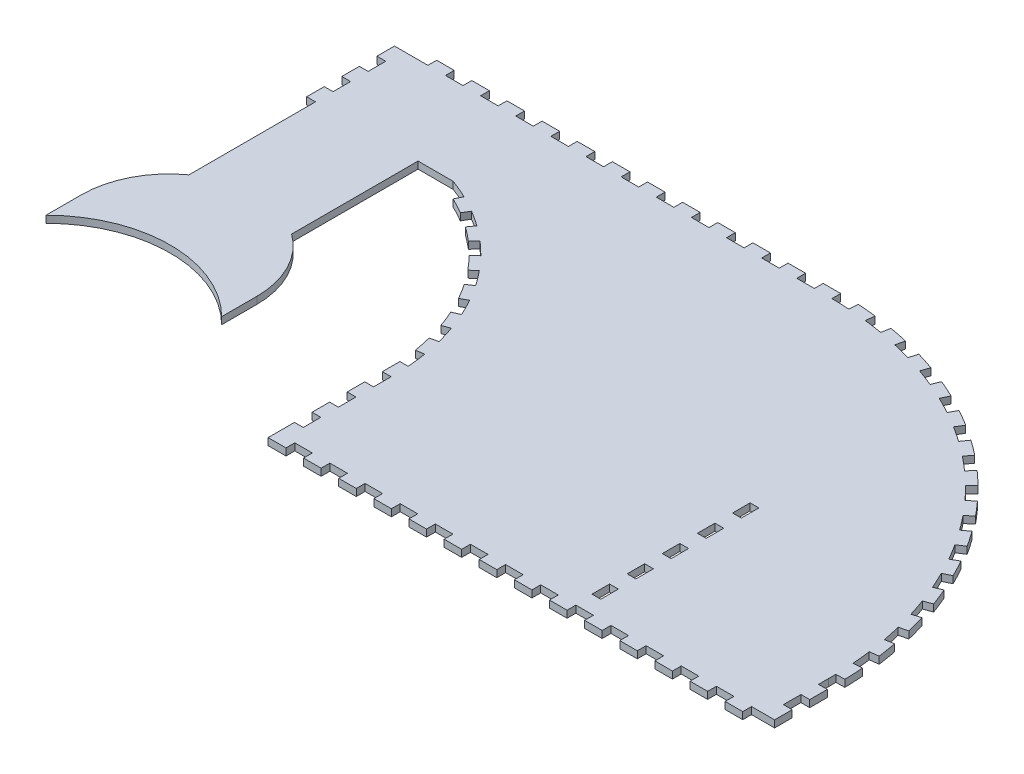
from build123d import *

# Parameters (mm, degrees)
MAIN_SHAPE_DEPTH                = 2.54
SKETCH17_W                      = 3.175
SKETCH17_H                      = 6.35
DISPLAY_AND_CONTROLS_DEPTH      = 3.175
SKETCH19_W                      = 3.175
SKETCH19_H                      = 6.35
TEETH_NEAR_BACK_DEPTH           = 2.54
LPATTERN1_COUNT                 = 3
LPATTERN1_PITCH                 = 12.7
SKETCH20_W                      = 3.175
SKETCH20_H                      = 6.35
TEETH_SHORT_EXTERIOR_DEPTH      = 2.54
LPATTERN2_COUNT                 = 2
LPATTERN2_PITCH                 = 12.7
TEETH_EXTERIOR_CURVE_DEPTH      = 2.54
TEETH_ACROSS_BACK_DEPTH         = 2.54
LPATTERN3_COUNT                 = 12
LPATTERN3_PITCH                 = 12.7
SKETCH23_W                      = 3.175
SKETCH23_H                      = 6.35
TEETH_SHORT_INTERIOR_DEPTH      = 2.54
LPATTERN4_COUNT                 = 4
LPATTERN4_PITCH                 = 12.7
TEETH_INTERIOR_CURVE_DEPTH      = 2.54
SKETCH25_W                      = 6.4516
SKETCH25_H                      = 3.175
TEETH_CORNER_SNAGGLETOOTH_DEPTH = 2.54
SKETCH26_W                      = 6.35
SKETCH26_H                      = 3.175
TEETH_ACROSS_FRONT_DEPTH        = 2.54
LPATTERN5_COUNT                 = 13
LPATTERN5_PITCH                 = 12.7
BOSS_EXTRUDE1_DEPTH             = 2.54


with BuildPart() as part:
    # Sketch1 → main shape (new body)
    with BuildSketch(Plane(origin=(0, 0, 0), x_dir=(1, 0, 0), z_dir=(0, 1, 0))):
        with BuildLine():
            Line((254.731571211, -49.489780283), (254.731571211, -26.862706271))
            ThreePointArc((254.731571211, -26.862706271), (219.698386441, 57.714883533), (135.120796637, 92.748068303))
            Line((135.120796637, 92.748068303), (43.942, 92.748068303))
            Line((43.942, 92.748068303), (-18.542, 92.748068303))
            Line((-18.542, 92.748068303), (-18.542, 60.998068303))
            Line((-18.542, 60.998068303), (-18.542, 22.898068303))
            Line((-18.542, 22.898068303), (18.542, 22.898068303))
            Line((18.542, 22.898068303), (18.542, 60.998068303))
            Line((18.542, 60.998068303), (31.242, 60.998068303))
            ThreePointArc((31.242, 60.998068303), (67.466558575, 33.08647736), (81.188839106, -10.536619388))
            Line((81.188839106, -10.536619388), (81.188839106, -49.489780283))
            Line((81.188839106, -49.489780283), (89.223526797, -49.489780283))
            Line((89.223526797, -49.489780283), (241.56969011, -49.489780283))
            Line((241.56969011, -49.489780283), (254.731571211, -49.489780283))
        make_face()
    extrude(amount=MAIN_SHAPE_DEPTH)

    # Sketch17 → display and controls (cut)
    with BuildSketch(Plane(origin=(0, 2.54, 0), x_dir=(1, 0, 0), z_dir=(0, 1, 0))):
        with Locations((187.140408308, -39.964780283)):
            Rectangle(SKETCH17_W, SKETCH17_H)
        with Locations((187.140408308, -27.264780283)):
            Rectangle(SKETCH17_W, SKETCH17_H)
        with Locations((187.140408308, -14.564780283)):
            Rectangle(SKETCH17_W, SKETCH17_H)
        with Locations((187.140408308, -1.864780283)):
            Rectangle(SKETCH17_W, SKETCH17_H)
        with Locations((187.140408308, 10.835219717)):
            Rectangle(SKETCH17_W, SKETCH17_H)
    extrude(amount=-DISPLAY_AND_CONTROLS_DEPTH, mode=Mode.SUBTRACT)

    # Sketch19 → teeth near back (add)
    with BuildSketch(Plane(origin=(0, 2.54, 0), x_dir=(1, 0, 0), z_dir=(0, 1, 0))):
        with Locations((-20.1295, 89.573068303)):
            Rectangle(SKETCH19_W, SKETCH19_H)
    teeth_near_back = extrude(amount=-TEETH_NEAR_BACK_DEPTH)

    # LPattern1: teeth near back ×3
    with Locations(*[(0, 0, i * LPATTERN1_PITCH) for i in range(1, LPATTERN1_COUNT)]):
        add(teeth_near_back)

    # Sketch20 → teeth short exterior (add)
    with BuildSketch(Plane(origin=(0, 2.54, 0), x_dir=(1, 0, 0), z_dir=(0, 1, 0))):
        with Locations((256.319071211, -46.314780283)):
            Rectangle(SKETCH20_W, SKETCH20_H)
    teeth_short_exterior = extrude(amount=-TEETH_SHORT_EXTERIOR_DEPTH)

    # LPattern2: teeth short exterior ×2
    with Locations(*[(0, 0, -i * LPATTERN2_PITCH) for i in range(1, LPATTERN2_COUNT)]):
        add(teeth_short_exterior)

    # Sketch21 → teeth exterior curve (add)
    with BuildSketch(Plane(origin=(0, 2.54, 0), x_dir=(1, 0, 0), z_dir=(0, 1, 0))):
        with BuildLine():
            Line((252.54392406, -24.210887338), (257.906571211, -24.089780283))
            ThreePointArc((257.906571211, -24.089780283), (257.783967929, -20.716002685), (257.568681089, -17.3468695))
            Line((257.568681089, -17.3468695), (252.22079123, -17.762472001))
            ThreePointArc((252.22079123, -17.762472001), (252.426675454, -20.984458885), (252.54392406, -24.210887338))
        make_face()
        with BuildLine():
            Line((251.543805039, -11.341555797), (256.860777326, -10.632713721))
            ThreePointArc((256.860777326, -10.632713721), (256.36869529, -7.292764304), (255.784999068, -3.967601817))
            Line((255.784999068, -3.967601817), (250.515011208, -4.967541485))
            ThreePointArc((250.515011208, -4.967541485), (251.0732146, -8.147478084), (251.543805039, -11.341555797))
        make_face()
        with BuildLine():
            ThreePointArc((247.415489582, 7.562937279), (248.31927011, 4.463458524), (249.137518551, 1.340309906))
            Line((249.137518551, 1.340309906), (254.344597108, 2.628325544))
            ThreePointArc((254.344597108, 2.628325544), (253.488979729, 5.894106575), (252.54392406, 9.135136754))
            Line((252.54392406, 9.135136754), (247.415489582, 7.562937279))
        make_face()
        with BuildLine():
            ThreePointArc((242.95966265, 19.677620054), (244.198104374, 16.696034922), (245.354127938, 13.681537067))
            Line((245.354127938, 13.681537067), (250.388421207, 15.533169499))
            ThreePointArc((250.388421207, 15.533169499), (249.179602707, 18.685337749), (247.884602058, 21.803090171))
            Line((247.884602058, 21.803090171), (242.95966265, 19.677620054))
        make_face()
        with BuildLine():
            ThreePointArc((237.201348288, 31.230184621), (238.759493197, 28.402504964), (240.239329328, 25.533067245))
            Line((240.239329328, 25.533067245), (245.040032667, 27.92595229))
            ThreePointArc((245.040032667, 27.92595229), (243.492613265, 30.926435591), (241.863308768, 33.883253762))
            Line((241.863308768, 33.883253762), (237.201348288, 31.230184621))
        make_face()
        with BuildLine():
            ThreePointArc((230.210095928, 42.081098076), (232.069124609, 39.441476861), (233.854899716, 36.751756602))
            Line((233.854899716, 36.751756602), (238.364029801, 39.656992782))
            ThreePointArc((238.364029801, 39.656992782), (236.496699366, 42.469551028), (234.552769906, 45.229722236))
            Line((234.552769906, 45.229722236), (230.210095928, 42.081098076))
        make_face()
        with BuildLine():
            ThreePointArc((222.07034654, 52.09930212), (224.20780548, 49.679620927), (226.27795081, 47.20210481))
            Line((226.27795081, 47.20210481), (230.441045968, 50.584602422))
            ThreePointArc((230.441045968, 50.584602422), (228.276358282, 53.175265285), (226.041282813, 55.705451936))
            Line((226.041282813, 55.705451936), (222.07034654, 52.09930212))
        make_face()
        with BuildLine():
            ThreePointArc((212.880412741, 61.163795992), (215.270485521, 58.993279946), (217.599997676, 56.757891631))
            Line((217.599997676, 56.757891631), (221.36677567, 60.576796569))
            ThreePointArc((221.36677567, 60.576796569), (218.930876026, 62.914273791), (216.431649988, 65.183916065))
            Line((216.431649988, 65.183916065), (212.880412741, 61.163795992))
        make_face()
        with BuildLine():
            ThreePointArc((202.751291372, 69.165097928), (205.365110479, 67.269962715), (207.925853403, 65.303701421))
            Line((207.925853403, 65.303701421), (211.250818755, 69.512888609))
            ThreePointArc((211.250818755, 69.512888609), (208.573128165, 71.568947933), (205.839937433, 73.55063289))
            Line((205.839937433, 73.55063289), (202.751291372, 69.165097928))
        make_face()
        with BuildLine():
            ThreePointArc((191.805322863, 76.006567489), (194.611318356, 74.409702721), (197.372363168, 72.736317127))
            Line((197.372363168, 72.736317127), (200.21535665, 77.284947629))
            ThreePointArc((200.21535665, 77.284947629), (197.328216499, 79.034755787), (194.394072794, 80.704548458))
            Line((194.394072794, 80.704548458), (191.805322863, 76.006567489))
        make_face()
        with BuildLine():
            ThreePointArc((180.174713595, 81.605572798), (183.138994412, 80.326265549), (186.066992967, 78.965966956))
            Line((186.066992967, 78.965966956), (188.39367665, 83.799102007))
            ThreePointArc((188.39367665, 83.799102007), (185.331958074, 85.22152466), (182.232300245, 86.55925714))
            Line((182.232300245, 86.55925714), (180.174713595, 81.605572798))
        make_face()
        with BuildLine():
            ThreePointArc((167.999939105, 85.894488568), (171.086702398, 84.948190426), (174.146290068, 83.917408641))
            Line((174.146290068, 83.917408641), (175.928562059, 88.976673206))
            ThreePointArc((175.928562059, 88.976673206), (172.729244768, 90.054530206), (169.501510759, 91.044045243))
            Line((169.501510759, 91.044045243), (167.999939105, 85.894488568))
        make_face()
        with BuildLine():
            ThreePointArc((155.428047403, 88.821512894), (158.600010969, 88.219653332), (161.754233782, 87.530838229))
            Line((161.754233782, 87.530838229), (162.970567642, 92.755126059))
            ThreePointArc((162.970567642, 92.755126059), (159.672293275, 93.475398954), (156.355467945, 94.104745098))
            Line((156.355467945, 94.104745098), (155.428047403, 88.821512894))
        make_face()
        with BuildLine():
            ThreePointArc((142.610882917, 90.351292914), (145.829735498, 90.101141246), (149.04049647, 89.762612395))
            Line((149.04049647, 89.762612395), (149.676201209, 95.088824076))
            ThreePointArc((149.676201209, 95.088824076), (146.318806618, 95.442813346), (142.952950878, 95.704389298))
            Line((142.952950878, 95.704389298), (142.610882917, 90.351292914))
        make_face()
    extrude(amount=-TEETH_EXTERIOR_CURVE_DEPTH)

    # Sketch22 → teeth across back (add)
    with BuildSketch(Plane(origin=(0, 2.54, 0), x_dir=(1, 0, 0), z_dir=(0, 1, 0))):
        Polygon((136.398481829, 92.504608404), (136.398481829, 95.923068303), (130.048481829, 95.923068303), (130.048481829, 92.748068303), align=None)
    teeth_across_back = extrude(amount=-TEETH_ACROSS_BACK_DEPTH)

    # LPattern3: teeth across back ×12
    with Locations(*[(-i * LPATTERN3_PITCH, 0, 0) for i in range(1, LPATTERN3_COUNT)]):
        add(teeth_across_back)

    # Sketch23 → teeth short interior (add)
    with BuildSketch(Plane(origin=(0, 2.54, 0), x_dir=(1, 0, 0), z_dir=(0, 1, 0))):
        with Locations((79.601339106, -46.314780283)):
            Rectangle(SKETCH23_W, SKETCH23_H)
    teeth_short_interior = extrude(amount=-TEETH_SHORT_INTERIOR_DEPTH)

    # LPattern4: teeth short interior ×4
    with Locations(*[(0, 0, -i * LPATTERN4_PITCH) for i in range(1, LPATTERN4_COUNT)]):
        add(teeth_short_interior)

    # Sketch24 → teeth interior curve (add)
    with BuildSketch(Plane(origin=(0, 2.54, 0), x_dir=(1, 0, 0), z_dir=(0, 1, 0))):
        with BuildLine():
            ThreePointArc((75.949909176, 7.557368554), (76.67161863, 4.444868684), (77.256875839, 1.303850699))
            Line((77.256875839, 1.303850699), (80.252161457, 1.794601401))
            ThreePointArc((80.252161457, 1.794601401), (79.642647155, 5.065804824), (78.891025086, 8.307308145))
            Line((78.891025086, 8.307308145), (75.949909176, 7.557368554))
        make_face()
        with BuildLine():
            ThreePointArc((71.72986304, 19.604740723), (72.981088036, 16.664850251), (74.102885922, 13.673180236))
            Line((74.102885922, 13.673180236), (76.967448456, 14.676601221))
            ThreePointArc((76.967448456, 14.676601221), (75.799155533, 17.792266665), (74.496071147, 20.854006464))
            Line((74.496071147, 20.854006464), (71.72986304, 19.604740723))
        make_face()
        with BuildLine():
            ThreePointArc((65.481924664, 30.736282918), (67.224647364, 28.058328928), (68.848900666, 25.306907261))
            Line((68.848900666, 25.306907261), (71.495701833, 26.792510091))
            ThreePointArc((71.495701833, 26.792510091), (69.804128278, 29.657969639), (67.989175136, 32.446916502))
            Line((67.989175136, 32.446916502), (65.481924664, 30.736282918))
        make_face()
        with BuildLine():
            ThreePointArc((57.395934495, 40.613768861), (59.577203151, 38.279119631), (61.654559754, 35.851546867))
            Line((61.654559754, 35.851546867), (64.00317784, 37.774192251))
            ThreePointArc((64.00317784, 37.774192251), (61.83972126, 40.302380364), (59.568045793, 42.733793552))
            Line((59.568045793, 42.733793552), (57.395934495, 40.613768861))
        make_face()
        with BuildLine():
            ThreePointArc((47.717581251, 48.93707614), (50.27111912, 47.016668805), (52.738459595, 44.986705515))
            Line((52.738459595, 44.986705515), (54.717533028, 47.287974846))
            ThreePointArc((54.717533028, 47.287974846), (52.147928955, 49.402073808), (49.488554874, 51.402076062))
            Line((49.488554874, 51.402076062), (47.717581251, 48.93707614))
        make_face()
        with BuildLine():
            ThreePointArc((36.7409368, 55.453305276), (39.589155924, 54.005490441), (42.37151138, 52.434816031))
            Line((42.37151138, 52.434816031), (43.920907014, 55.044786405))
            ThreePointArc((43.920907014, 55.044786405), (41.023231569, 56.68056039), (38.05696261, 58.188382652))
            Line((38.05696261, 58.188382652), (36.7409368, 55.453305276))
        make_face()
    extrude(amount=-TEETH_INTERIOR_CURVE_DEPTH)

    # Sketch25 → teeth corner snaggletooth (add)
    with BuildSketch(Plane(origin=(0, 2.54, 0), x_dir=(1, 0, 0), z_dir=(0, 1, 0))):
        with Locations((81.239639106, -51.077280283)):
            Rectangle(SKETCH25_W, SKETCH25_H)
    extrude(amount=-TEETH_CORNER_SNAGGLETOOTH_DEPTH)

    # Sketch26 → teeth across front (add)
    with BuildSketch(Plane(origin=(0, 2.54, 0), x_dir=(1, 0, 0), z_dir=(0, 1, 0))):
        with Locations((93.990439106, -51.077280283)):
            Rectangle(SKETCH26_W, SKETCH26_H)
    teeth_across_front = extrude(amount=-TEETH_ACROSS_FRONT_DEPTH)

    # LPattern5: teeth across front ×13
    with Locations(*[(i * LPATTERN5_PITCH, 0, 0) for i in range(1, LPATTERN5_COUNT)]):
        add(teeth_across_front)

    # Sketch27 → Boss-Extrude1 (add)
    with BuildSketch(Plane(origin=(0, 2.54, 0), x_dir=(1, 0, 0), z_dir=(0, 1, 0))):
        with BuildLine():
            Line((0, 21.254889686), (0, 60.998068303))
            Line((0, 60.998068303), (-18.542, 60.998068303))
            Line((-18.542, 60.998068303), (-18.542, 15.278068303))
            ThreePointArc((-18.542, 15.278068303), (-9.740741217, 19.723765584), (0, 21.254889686))
        make_face()
        with BuildLine():
            Line((18.542, 15.278068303), (18.542, 60.998068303))
            Line((18.542, 60.998068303), (0, 60.998068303))
            Line((0, 60.998068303), (0, 21.254889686))
            ThreePointArc((0, 21.254889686), (9.740741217, 19.723765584), (18.542, 15.278068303))
        make_face()
        with BuildLine():
            Line((0, 15.278068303), (18.542, 15.278068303))
            ThreePointArc((18.542, 15.278068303), (9.740741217, 19.723765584), (0, 21.254889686))
            Line((0, 21.254889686), (0, 15.278068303))
        make_face()
        with BuildLine():
            Line((-18.542, 15.278068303), (0, 15.278068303))
            Line((0, 15.278068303), (0, 21.254889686))
            ThreePointArc((0, 21.254889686), (-9.740741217, 19.723765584), (-18.542, 15.278068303))
        make_face()
        with BuildLine():
            Line((0, 15.278068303), (18.542, 15.278068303))
            ThreePointArc((18.542, 15.278068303), (9.740741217, 19.723765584), (0, 21.254889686))
            Line((0, 21.254889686), (0, 15.278068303))
        make_face()
        with BuildLine():
            Line((-18.542, 15.278068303), (0, 15.278068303))
            Line((0, 15.278068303), (0, 21.254889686))
            ThreePointArc((0, 21.254889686), (-9.740741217, 19.723765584), (-18.542, 15.278068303))
        make_face()
        with BuildLine():
            Line((0, -10.043829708), (0, 15.278068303))
            Line((0, 15.278068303), (-18.542, 15.278068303))
            ThreePointArc((-18.542, 15.278068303), (-28.255716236, 3.985117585), (-31.75, -10.495110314))
            Line((-31.75, -10.495110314), (-31.75, -23.195110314))
            ThreePointArc((-31.75, -23.195110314), (-17.18297618, -13.461736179), (0, -10.043829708))
        make_face()
        with BuildLine():
            ThreePointArc((31.75, -10.495110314), (28.255716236, 3.985117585), (18.542, 15.278068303))
            Line((18.542, 15.278068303), (0, 15.278068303))
            Line((0, 15.278068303), (0, -10.043829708))
            ThreePointArc((0, -10.043829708), (17.18297618, -13.461736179), (31.75, -23.195110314))
            Line((31.75, -23.195110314), (31.75, -10.495110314))
        make_face()
    extrude(amount=-BOSS_EXTRUDE1_DEPTH)


solid = part.part
